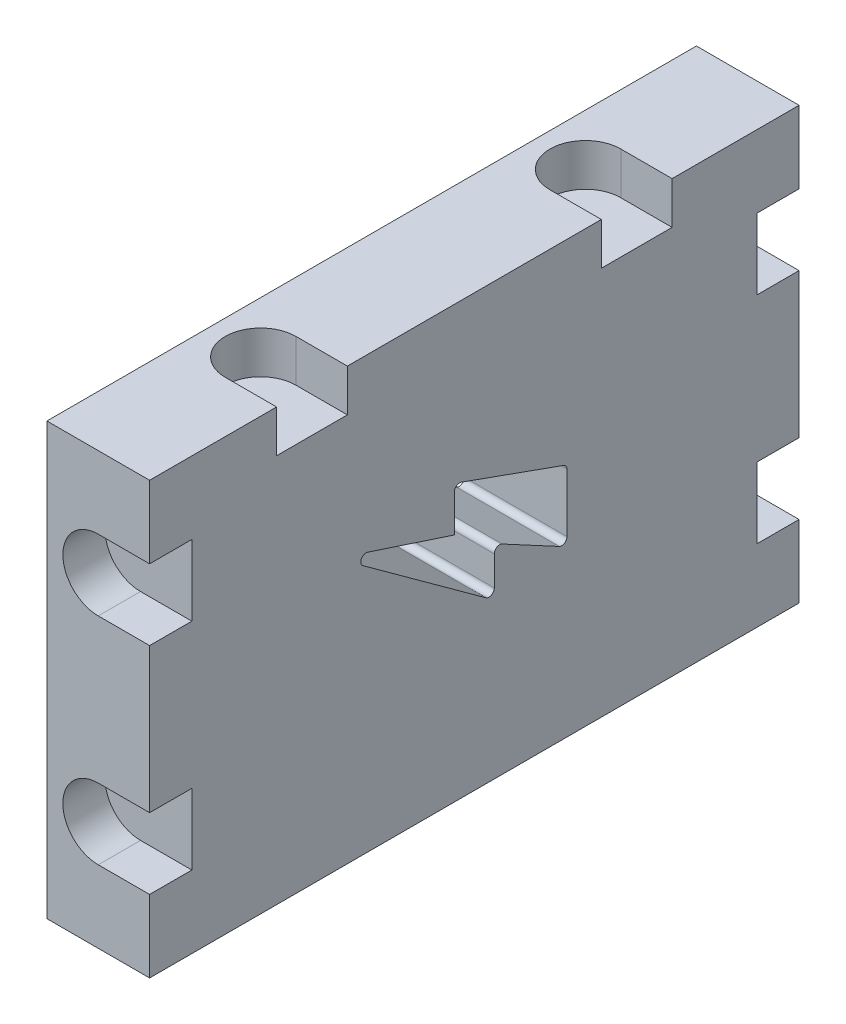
ISO-10303-21;
HEADER;
FILE_DESCRIPTION(('STEP AP214'),'2;1');
FILE_NAME('part.step','',(''),(''),'','','');
FILE_SCHEMA(('AUTOMOTIVE_DESIGN { 1 0 10303 214 1 1 1 1 }'));
ENDSEC;
DATA;
#1=APPLICATION_CONTEXT('core data for automotive mechanical design processes');
#2=APPLICATION_PROTOCOL_DEFINITION('international standard','automotive_design',2000,#1);
#3=PRODUCT_CONTEXT('',#1,'mechanical');
#4=PRODUCT('Part','Part','',(#3));
#5=PRODUCT_RELATED_PRODUCT_CATEGORY('part','',(#4));
#6=PRODUCT_DEFINITION_FORMATION('','',#4);
#7=PRODUCT_DEFINITION_CONTEXT('part definition',#1,'design');
#8=PRODUCT_DEFINITION('design','',#6,#7);
#9=PRODUCT_DEFINITION_SHAPE('','',#8);
#10=(LENGTH_UNIT() NAMED_UNIT(*) SI_UNIT(.MILLI.,.METRE.));
#11=(NAMED_UNIT(*) PLANE_ANGLE_UNIT() SI_UNIT($,.RADIAN.));
#12=(NAMED_UNIT(*) SI_UNIT($,.STERADIAN.) SOLID_ANGLE_UNIT());
#13=UNCERTAINTY_MEASURE_WITH_UNIT(LENGTH_MEASURE(1.E-05),#10,'distance_accuracy_value','');
#14=(GEOMETRIC_REPRESENTATION_CONTEXT(3) GLOBAL_UNCERTAINTY_ASSIGNED_CONTEXT((#13)) GLOBAL_UNIT_ASSIGNED_CONTEXT((#10,
#11,#12)) REPRESENTATION_CONTEXT('',''));
#15=CARTESIAN_POINT('',(0.,0.,0.));
#16=DIRECTION('',(0.,0.,1.));
#17=DIRECTION('',(1.,0.,0.));
#18=AXIS2_PLACEMENT_3D('',#15,#16,#17);
#19=CARTESIAN_POINT('',(-821.069349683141,746.835138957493,0.));
#20=DIRECTION('',(1.,0.,0.));
#21=DIRECTION('',(0.,0.,-1.));
#22=AXIS2_PLACEMENT_3D('',#19,#20,#21);
#23=PLANE('',#22);
#24=CARTESIAN_POINT('',(-821.069349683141,638.866565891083,-49.5375809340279));
#25=DIRECTION('',(-1.,0.,0.));
#26=DIRECTION('',(0.,0.,1.));
#27=AXIS2_PLACEMENT_3D('',#24,#25,#26);
#28=CIRCLE('',#27,0.63499999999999);
#29=CARTESIAN_POINT('',(-821.069349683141,638.307029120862,-49.2373416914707));
#30=VERTEX_POINT('',#29);
#31=CARTESIAN_POINT('',(-821.069349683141,638.866565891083,-50.1725809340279));
#32=VERTEX_POINT('',#31);
#33=EDGE_CURVE('E360',#30,#32,#28,.F.);
#34=ORIENTED_EDGE('',*,*,#33,.F.);
#35=DIRECTION('',(0.,-0.472817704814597,-0.881160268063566));
#36=VECTOR('',#35,1.);
#37=CARTESIAN_POINT('',(-821.069349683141,516.122955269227,-276.94402477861));
#38=LINE('',#37,#36);
#39=CARTESIAN_POINT('',(-821.069349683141,641.990844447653,-42.3720494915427));
#40=VERTEX_POINT('',#39);
#41=EDGE_CURVE('E357',#40,#30,#38,.T.);
#42=ORIENTED_EDGE('',*,*,#41,.F.);
#43=CARTESIAN_POINT('',(-821.069349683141,641.431307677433,-42.0718102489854));
#44=DIRECTION('',(-1.,0.,0.));
#45=DIRECTION('',(0.,0.,1.));
#46=AXIS2_PLACEMENT_3D('',#43,#44,#45);
#47=CIRCLE('',#46,0.634999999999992);
#48=CARTESIAN_POINT('',(-821.069349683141,641.431307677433,-41.4368102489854));
#49=VERTEX_POINT('',#48);
#50=EDGE_CURVE('E363',#40,#49,#47,.F.);
#51=ORIENTED_EDGE('',*,*,#50,.T.);
#52=DIRECTION('',(0.,1.,0.));
#53=VECTOR('',#52,1.);
#54=CARTESIAN_POINT('',(-821.069349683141,0.,-41.4368102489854));
#55=LINE('',#54,#53);
#56=CARTESIAN_POINT('',(-821.069349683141,637.879291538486,-41.4368102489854));
#57=VERTEX_POINT('',#56);
#58=EDGE_CURVE('E367',#57,#49,#55,.T.);
#59=ORIENTED_EDGE('',*,*,#58,.F.);
#60=CARTESIAN_POINT('',(-821.069349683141,637.879291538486,-40.8018102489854));
#61=DIRECTION('',(-1.,0.,0.));
#62=DIRECTION('',(0.,0.,1.));
#63=AXIS2_PLACEMENT_3D('',#60,#61,#62);
#64=CIRCLE('',#63,0.634999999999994);
#65=CARTESIAN_POINT('',(-821.069349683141,637.365495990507,-40.4286626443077));
#66=VERTEX_POINT('',#65);
#67=EDGE_CURVE('E379',#66,#57,#64,.F.);
#68=ORIENTED_EDGE('',*,*,#67,.F.);
#69=DIRECTION('',(0.,-0.58763402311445,-0.80912684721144));
#70=VECTOR('',#69,1.);
#71=CARTESIAN_POINT('',(-821.069349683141,436.497064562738,-317.009041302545));
#72=LINE('',#71,#70);
#73=CARTESIAN_POINT('',(-821.069349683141,648.10137604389,-25.646181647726));
#74=VERTEX_POINT('',#73);
#75=EDGE_CURVE('E381',#74,#66,#72,.T.);
#76=ORIENTED_EDGE('',*,*,#75,.F.);
#77=CARTESIAN_POINT('',(-821.069349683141,648.615171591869,-26.0193292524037));
#78=DIRECTION('',(-1.,0.,0.));
#79=DIRECTION('',(0.,0.,1.));
#80=AXIS2_PLACEMENT_3D('',#77,#78,#79);
#81=CIRCLE('',#80,0.635000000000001);
#82=CARTESIAN_POINT('',(-821.069349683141,649.218479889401,-26.2174304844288));
#83=VERTEX_POINT('',#82);
#84=EDGE_CURVE('E383',#83,#74,#81,.F.);
#85=ORIENTED_EDGE('',*,*,#84,.F.);
#86=DIRECTION('',(0.,0.311970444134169,0.950091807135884));
#87=VECTOR('',#86,1.);
#88=CARTESIAN_POINT('',(-821.069349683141,593.803790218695,-194.980349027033));
#89=LINE('',#88,#87);
#90=CARTESIAN_POINT('',(-821.069349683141,645.795227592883,-36.6427897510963));
#91=VERTEX_POINT('',#90);
#92=EDGE_CURVE('E385',#91,#83,#89,.T.);
#93=ORIENTED_EDGE('',*,*,#92,.F.);
#94=DIRECTION('',(0.,-1.,0.));
#95=VECTOR('',#94,1.);
#96=CARTESIAN_POINT('',(-821.069349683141,0.,-36.6427897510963));
#97=LINE('',#96,#95);
#98=CARTESIAN_POINT('',(-821.069349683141,650.273160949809,-36.6427897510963));
#99=VERTEX_POINT('',#98);
#100=EDGE_CURVE('E387',#99,#91,#97,.T.);
#101=ORIENTED_EDGE('',*,*,#100,.F.);
#102=CARTESIAN_POINT('',(-821.069349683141,650.273160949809,-37.2777897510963));
#103=DIRECTION('',(-1.,0.,0.));
#104=DIRECTION('',(0.,0.,1.));
#105=AXIS2_PLACEMENT_3D('',#102,#103,#104);
#106=CIRCLE('',#105,0.635000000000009);
#107=CARTESIAN_POINT('',(-821.069349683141,650.870953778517,-37.4919596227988));
#108=VERTEX_POINT('',#107);
#109=EDGE_CURVE('E389',#108,#99,#106,.F.);
#110=ORIENTED_EDGE('',*,*,#109,.F.);
#111=DIRECTION('',(0.,0.337275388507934,0.941406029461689));
#112=VECTOR('',#111,1.);
#113=CARTESIAN_POINT('',(-821.069349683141,588.735519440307,-210.924930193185));
#114=LINE('',#113,#112);
#115=CARTESIAN_POINT('',(-821.069349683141,646.478666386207,-49.7517508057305));
#116=VERTEX_POINT('',#115);
#117=EDGE_CURVE('E391',#116,#108,#114,.T.);
#118=ORIENTED_EDGE('',*,*,#117,.F.);
#119=CARTESIAN_POINT('',(-821.069349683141,645.880873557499,-49.5375809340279));
#120=DIRECTION('',(-1.,0.,0.));
#121=DIRECTION('',(0.,0.,1.));
#122=AXIS2_PLACEMENT_3D('',#119,#120,#121);
#123=CIRCLE('',#122,0.635000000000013);
#124=CARTESIAN_POINT('',(-821.069349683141,645.880873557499,-50.1725809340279));
#125=VERTEX_POINT('',#124);
#126=EDGE_CURVE('E393',#125,#116,#123,.F.);
#127=ORIENTED_EDGE('',*,*,#126,.F.);
#128=DIRECTION('',(0.,1.,0.));
#129=VECTOR('',#128,1.);
#130=CARTESIAN_POINT('',(-821.069349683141,0.,-50.1725809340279));
#131=LINE('',#130,#129);
#132=EDGE_CURVE('E395',#32,#125,#131,.T.);
#133=ORIENTED_EDGE('',*,*,#132,.F.);
#134=EDGE_LOOP('',(#34,#42,#51,#59,#68,#76,#85,#93,#101,#110,#118,#127,#133));
#135=FACE_BOUND('',#134,.T.);
#136=DIRECTION('',(0.,-1.,0.));
#137=VECTOR('',#136,1.);
#138=CARTESIAN_POINT('',(-821.069349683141,746.835138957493,-78.0796));
#139=LINE('',#138,#137);
#140=CARTESIAN_POINT('',(-821.069349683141,652.60515215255,-78.0796));
#141=VERTEX_POINT('',#140);
#142=CARTESIAN_POINT('',(-821.069349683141,635.203353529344,-78.0796));
#143=VERTEX_POINT('',#142);
#144=EDGE_CURVE('E667',#141,#143,#139,.T.);
#145=ORIENTED_EDGE('',*,*,#144,.F.);
#146=DIRECTION('',(0.,0.,-1.));
#147=VECTOR('',#146,1.);
#148=CARTESIAN_POINT('',(-821.069349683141,652.60515215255,-72.9996));
#149=LINE('',#148,#147);
#150=CARTESIAN_POINT('',(-821.069349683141,652.60515215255,-72.9996));
#151=VERTEX_POINT('',#150);
#152=EDGE_CURVE('E479',#151,#141,#149,.T.);
#153=ORIENTED_EDGE('',*,*,#152,.F.);
#154=DIRECTION('',(0.,-1.,0.));
#155=VECTOR('',#154,1.);
#156=CARTESIAN_POINT('',(-821.069349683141,0.,-72.9996));
#157=LINE('',#156,#155);
#158=CARTESIAN_POINT('',(-821.069349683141,661.11415215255,-72.9996));
#159=VERTEX_POINT('',#158);
#160=EDGE_CURVE('E460',#159,#151,#157,.T.);
#161=ORIENTED_EDGE('',*,*,#160,.F.);
#162=DIRECTION('',(0.,0.,-1.));
#163=VECTOR('',#162,1.);
#164=CARTESIAN_POINT('',(-821.069349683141,661.11415215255,-72.9996));
#165=LINE('',#164,#163);
#166=CARTESIAN_POINT('',(-821.069349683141,661.11415215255,-78.0796));
#167=VERTEX_POINT('',#166);
#168=EDGE_CURVE('E481',#159,#167,#165,.T.);
#169=ORIENTED_EDGE('',*,*,#168,.T.);
#170=CARTESIAN_POINT('',(-821.069349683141,669.815051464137,-78.0796));
#171=VERTEX_POINT('',#170);
#172=EDGE_CURVE('E665',#171,#167,#139,.T.);
#173=ORIENTED_EDGE('',*,*,#172,.F.);
#174=DIRECTION('',(0.,0.,1.));
#175=VECTOR('',#174,1.);
#176=CARTESIAN_POINT('',(-821.069349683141,669.815051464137,0.));
#177=LINE('',#176,#175);
#178=CARTESIAN_POINT('',(-821.069349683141,669.815051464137,-62.8141999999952));
#179=VERTEX_POINT('',#178);
#180=EDGE_CURVE('E647',#171,#179,#177,.T.);
#181=ORIENTED_EDGE('',*,*,#180,.T.);
#182=DIRECTION('',(0.,1.,0.));
#183=VECTOR('',#182,1.);
#184=CARTESIAN_POINT('',(-821.069349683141,664.735051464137,-62.8141999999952));
#185=LINE('',#184,#183);
#186=CARTESIAN_POINT('',(-821.069349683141,664.735051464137,-62.8141999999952));
#187=VERTEX_POINT('',#186);
#188=EDGE_CURVE('E599',#187,#179,#185,.T.);
#189=ORIENTED_EDGE('',*,*,#188,.F.);
#190=DIRECTION('',(0.,0.,-1.));
#191=VECTOR('',#190,1.);
#192=CARTESIAN_POINT('',(-821.069349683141,664.735051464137,0.));
#193=LINE('',#192,#191);
#194=CARTESIAN_POINT('',(-821.069349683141,664.735051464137,-54.305199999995));
#195=VERTEX_POINT('',#194);
#196=EDGE_CURVE('E580',#195,#187,#193,.T.);
#197=ORIENTED_EDGE('',*,*,#196,.F.);
#198=DIRECTION('',(0.,1.,0.));
#199=VECTOR('',#198,1.);
#200=CARTESIAN_POINT('',(-821.069349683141,664.735051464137,-54.305199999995));
#201=LINE('',#200,#199);
#202=CARTESIAN_POINT('',(-821.069349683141,669.815051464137,-54.305199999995));
#203=VERTEX_POINT('',#202);
#204=EDGE_CURVE('E601',#195,#203,#201,.T.);
#205=ORIENTED_EDGE('',*,*,#204,.T.);
#206=CARTESIAN_POINT('',(-821.069349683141,669.815051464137,-23.7743999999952));
#207=VERTEX_POINT('',#206);
#208=EDGE_CURVE('E651',#203,#207,#177,.T.);
#209=ORIENTED_EDGE('',*,*,#208,.T.);
#210=DIRECTION('',(0.,1.,0.));
#211=VECTOR('',#210,1.);
#212=CARTESIAN_POINT('',(-821.069349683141,664.735051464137,-23.7743999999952));
#213=LINE('',#212,#211);
#214=CARTESIAN_POINT('',(-821.069349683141,664.735051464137,-23.7743999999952));
#215=VERTEX_POINT('',#214);
#216=EDGE_CURVE('E627',#215,#207,#213,.T.);
#217=ORIENTED_EDGE('',*,*,#216,.F.);
#218=DIRECTION('',(0.,0.,-1.));
#219=VECTOR('',#218,1.);
#220=CARTESIAN_POINT('',(-821.069349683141,664.735051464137,0.));
#221=LINE('',#220,#219);
#222=CARTESIAN_POINT('',(-821.069349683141,664.735051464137,-15.265399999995));
#223=VERTEX_POINT('',#222);
#224=EDGE_CURVE('E612',#223,#215,#221,.T.);
#225=ORIENTED_EDGE('',*,*,#224,.F.);
#226=DIRECTION('',(0.,1.,0.));
#227=VECTOR('',#226,1.);
#228=CARTESIAN_POINT('',(-821.069349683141,664.735051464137,-15.265399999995));
#229=LINE('',#228,#227);
#230=CARTESIAN_POINT('',(-821.069349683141,669.815051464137,-15.265399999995));
#231=VERTEX_POINT('',#230);
#232=EDGE_CURVE('E629',#223,#231,#229,.T.);
#233=ORIENTED_EDGE('',*,*,#232,.T.);
#234=CARTESIAN_POINT('',(-821.069349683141,669.815051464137,0.));
#235=VERTEX_POINT('',#234);
#236=EDGE_CURVE('E646',#231,#235,#177,.T.);
#237=ORIENTED_EDGE('',*,*,#236,.T.);
#238=DIRECTION('',(0.,1.,0.));
#239=VECTOR('',#238,1.);
#240=CARTESIAN_POINT('',(-821.069349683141,746.835138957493,0.));
#241=LINE('',#240,#239);
#242=CARTESIAN_POINT('',(-821.069349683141,661.114152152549,0.));
#243=VERTEX_POINT('',#242);
#244=EDGE_CURVE('E100',#243,#235,#241,.T.);
#245=ORIENTED_EDGE('',*,*,#244,.F.);
#246=DIRECTION('',(0.,0.,1.));
#247=VECTOR('',#246,1.);
#248=CARTESIAN_POINT('',(-821.069349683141,661.114152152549,-5.08));
#249=LINE('',#248,#247);
#250=CARTESIAN_POINT('',(-821.069349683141,661.114152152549,-5.08));
#251=VERTEX_POINT('',#250);
#252=EDGE_CURVE('E567',#251,#243,#249,.T.);
#253=ORIENTED_EDGE('',*,*,#252,.F.);
#254=DIRECTION('',(0.,1.,0.));
#255=VECTOR('',#254,1.);
#256=CARTESIAN_POINT('',(-821.069349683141,0.,-5.08));
#257=LINE('',#256,#255);
#258=CARTESIAN_POINT('',(-821.069349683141,652.605152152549,-5.08));
#259=VERTEX_POINT('',#258);
#260=EDGE_CURVE('E552',#259,#251,#257,.T.);
#261=ORIENTED_EDGE('',*,*,#260,.F.);
#262=DIRECTION('',(0.,0.,1.));
#263=VECTOR('',#262,1.);
#264=CARTESIAN_POINT('',(-821.069349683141,652.605152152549,-5.08));
#265=LINE('',#264,#263);
#266=CARTESIAN_POINT('',(-821.069349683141,652.605152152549,0.));
#267=VERTEX_POINT('',#266);
#268=EDGE_CURVE('E569',#259,#267,#265,.T.);
#269=ORIENTED_EDGE('',*,*,#268,.T.);
#270=CARTESIAN_POINT('',(-821.069349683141,635.203353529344,0.));
#271=VERTEX_POINT('',#270);
#272=EDGE_CURVE('E99',#271,#267,#241,.T.);
#273=ORIENTED_EDGE('',*,*,#272,.F.);
#274=DIRECTION('',(0.,0.,1.));
#275=VECTOR('',#274,1.);
#276=CARTESIAN_POINT('',(-821.069349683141,635.203353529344,-5.08));
#277=LINE('',#276,#275);
#278=CARTESIAN_POINT('',(-821.069349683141,635.203353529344,-5.08));
#279=VERTEX_POINT('',#278);
#280=EDGE_CURVE('E539',#279,#271,#277,.T.);
#281=ORIENTED_EDGE('',*,*,#280,.F.);
#282=DIRECTION('',(0.,1.,0.));
#283=VECTOR('',#282,1.);
#284=CARTESIAN_POINT('',(-821.069349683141,0.,-5.08));
#285=LINE('',#284,#283);
#286=CARTESIAN_POINT('',(-821.069349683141,626.694353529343,-5.08));
#287=VERTEX_POINT('',#286);
#288=EDGE_CURVE('E520',#287,#279,#285,.T.);
#289=ORIENTED_EDGE('',*,*,#288,.F.);
#290=DIRECTION('',(0.,0.,1.));
#291=VECTOR('',#290,1.);
#292=CARTESIAN_POINT('',(-821.069349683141,626.694353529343,-5.08));
#293=LINE('',#292,#291);
#294=CARTESIAN_POINT('',(-821.069349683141,626.694353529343,0.));
#295=VERTEX_POINT('',#294);
#296=EDGE_CURVE('E541',#287,#295,#293,.T.);
#297=ORIENTED_EDGE('',*,*,#296,.T.);
#298=CARTESIAN_POINT('',(-821.069349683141,617.993454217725,0.));
#299=VERTEX_POINT('',#298);
#300=EDGE_CURVE('E12',#299,#295,#241,.T.);
#301=ORIENTED_EDGE('',*,*,#300,.F.);
#302=DIRECTION('',(0.,0.,-1.));
#303=VECTOR('',#302,1.);
#304=CARTESIAN_POINT('',(-821.069349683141,617.993454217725,0.));
#305=LINE('',#304,#303);
#306=CARTESIAN_POINT('',(-821.069349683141,617.993454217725,-78.0796));
#307=VERTEX_POINT('',#306);
#308=EDGE_CURVE('E662',#299,#307,#305,.T.);
#309=ORIENTED_EDGE('',*,*,#308,.T.);
#310=CARTESIAN_POINT('',(-821.069349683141,626.694353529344,-78.0796));
#311=VERTEX_POINT('',#310);
#312=EDGE_CURVE('E664',#311,#307,#139,.T.);
#313=ORIENTED_EDGE('',*,*,#312,.F.);
#314=DIRECTION('',(0.,0.,-1.));
#315=VECTOR('',#314,1.);
#316=CARTESIAN_POINT('',(-821.069349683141,626.694353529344,-72.9996));
#317=LINE('',#316,#315);
#318=CARTESIAN_POINT('',(-821.069349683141,626.694353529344,-72.9996));
#319=VERTEX_POINT('',#318);
#320=EDGE_CURVE('E507',#319,#311,#317,.T.);
#321=ORIENTED_EDGE('',*,*,#320,.F.);
#322=DIRECTION('',(0.,-1.,0.));
#323=VECTOR('',#322,1.);
#324=CARTESIAN_POINT('',(-821.069349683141,0.,-72.9996));
#325=LINE('',#324,#323);
#326=CARTESIAN_POINT('',(-821.069349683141,635.203353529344,-72.9996));
#327=VERTEX_POINT('',#326);
#328=EDGE_CURVE('E492',#327,#319,#325,.T.);
#329=ORIENTED_EDGE('',*,*,#328,.F.);
#330=DIRECTION('',(0.,0.,-1.));
#331=VECTOR('',#330,1.);
#332=CARTESIAN_POINT('',(-821.069349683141,635.203353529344,-72.9996));
#333=LINE('',#332,#331);
#334=EDGE_CURVE('E509',#327,#143,#333,.T.);
#335=ORIENTED_EDGE('',*,*,#334,.T.);
#336=EDGE_LOOP('',(#145,#153,#161,#169,#173,#181,#189,#197,#205,#209,#217,#225,#233,#237,#245,
#253,#261,#269,#273,#281,#289,#297,#301,#309,#313,#321,#329,#335));
#337=FACE_BOUND('',#336,.T.);
#338=ADVANCED_FACE('F91',(#135,#337),#23,.T.);
#339=CARTESIAN_POINT('',(0.,1230.90690843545,-78.0796));
#340=DIRECTION('',(0.,0.,-1.));
#341=DIRECTION('',(-1.,0.,0.));
#342=AXIS2_PLACEMENT_3D('',#339,#340,#341);
#343=PLANE('',#342);
#344=CARTESIAN_POINT('',(-827.139949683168,656.85965215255,-78.0796));
#345=DIRECTION('',(0.,0.,-1.));
#346=DIRECTION('',(-1.,0.,0.));
#347=AXIS2_PLACEMENT_3D('',#344,#345,#346);
#348=CIRCLE('',#347,4.25450000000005);
#349=CARTESIAN_POINT('',(-827.139949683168,661.11415215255,-78.0796));
#350=VERTEX_POINT('',#349);
#351=CARTESIAN_POINT('',(-827.139949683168,652.60515215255,-78.0796));
#352=VERTEX_POINT('',#351);
#353=EDGE_CURVE('E466',#350,#352,#348,.F.);
#354=ORIENTED_EDGE('',*,*,#353,.T.);
#355=DIRECTION('',(1.,0.,0.));
#356=VECTOR('',#355,1.);
#357=CARTESIAN_POINT('',(-1.17387198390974E-11,652.605152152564,-78.0796));
#358=LINE('',#357,#356);
#359=EDGE_CURVE('E458',#352,#141,#358,.T.);
#360=ORIENTED_EDGE('',*,*,#359,.T.);
#361=ORIENTED_EDGE('',*,*,#144,.T.);
#362=DIRECTION('',(-1.,0.,0.));
#363=VECTOR('',#362,1.);
#364=CARTESIAN_POINT('',(-1.14257053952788E-11,635.203353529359,-78.0796));
#365=LINE('',#364,#363);
#366=CARTESIAN_POINT('',(-827.139949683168,635.203353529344,-78.0796));
#367=VERTEX_POINT('',#366);
#368=EDGE_CURVE('E500',#143,#367,#365,.T.);
#369=ORIENTED_EDGE('',*,*,#368,.T.);
#370=CARTESIAN_POINT('',(-827.139949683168,630.948853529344,-78.0796));
#371=DIRECTION('',(0.,0.,-1.));
#372=DIRECTION('',(-1.,0.,0.));
#373=AXIS2_PLACEMENT_3D('',#370,#371,#372);
#374=CIRCLE('',#373,4.25450000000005);
#375=CARTESIAN_POINT('',(-827.139949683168,626.694353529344,-78.0796));
#376=VERTEX_POINT('',#375);
#377=EDGE_CURVE('E432',#367,#376,#374,.F.);
#378=ORIENTED_EDGE('',*,*,#377,.T.);
#379=DIRECTION('',(1.,0.,0.));
#380=VECTOR('',#379,1.);
#381=CARTESIAN_POINT('',(-1.12726499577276E-11,626.694353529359,-78.0796));
#382=LINE('',#381,#380);
#383=EDGE_CURVE('E490',#376,#311,#382,.T.);
#384=ORIENTED_EDGE('',*,*,#383,.T.);
#385=ORIENTED_EDGE('',*,*,#312,.T.);
#386=DIRECTION('',(1.,0.,0.));
#387=VECTOR('',#386,1.);
#388=CARTESIAN_POINT('',(-820.002549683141,617.993454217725,-78.0796));
#389=LINE('',#388,#387);
#390=CARTESIAN_POINT('',(-833.413749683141,617.993454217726,-78.0796));
#391=VERTEX_POINT('',#390);
#392=EDGE_CURVE('E650',#391,#307,#389,.T.);
#393=ORIENTED_EDGE('',*,*,#392,.F.);
#394=DIRECTION('',(0.,-1.,0.));
#395=VECTOR('',#394,1.);
#396=CARTESIAN_POINT('',(-833.413749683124,1230.90690843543,-78.0796));
#397=LINE('',#396,#395);
#398=CARTESIAN_POINT('',(-833.413749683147,669.815051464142,-78.0796));
#399=VERTEX_POINT('',#398);
#400=EDGE_CURVE('E636',#399,#391,#397,.T.);
#401=ORIENTED_EDGE('',*,*,#400,.F.);
#402=DIRECTION('',(-1.,0.,0.));
#403=VECTOR('',#402,1.);
#404=CARTESIAN_POINT('',(-899.286453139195,669.815051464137,-78.0796));
#405=LINE('',#404,#403);
#406=EDGE_CURVE('E640',#171,#399,#405,.T.);
#407=ORIENTED_EDGE('',*,*,#406,.F.);
#408=ORIENTED_EDGE('',*,*,#172,.T.);
#409=DIRECTION('',(-1.,0.,0.));
#410=VECTOR('',#409,1.);
#411=CARTESIAN_POINT('',(-1.18917752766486E-11,661.114152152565,-78.0796));
#412=LINE('',#411,#410);
#413=EDGE_CURVE('E469',#167,#350,#412,.T.);
#414=ORIENTED_EDGE('',*,*,#413,.T.);
#415=EDGE_LOOP('',(#354,#360,#361,#369,#378,#384,#385,#393,#401,#407,#408,#414));
#416=FACE_BOUND('',#415,.T.);
#417=ADVANCED_FACE('F673',(#416),#343,.T.);
#418=CARTESIAN_POINT('',(0.,1230.90690843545,0.));
#419=DIRECTION('',(0.,0.,1.));
#420=DIRECTION('',(1.,0.,0.));
#421=AXIS2_PLACEMENT_3D('',#418,#419,#420);
#422=PLANE('',#421);
#423=CARTESIAN_POINT('',(-827.241549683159,630.948853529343,0.));
#424=DIRECTION('',(0.,0.,1.));
#425=DIRECTION('',(1.,0.,0.));
#426=AXIS2_PLACEMENT_3D('',#423,#424,#425);
#427=CIRCLE('',#426,4.25450000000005);
#428=CARTESIAN_POINT('',(-827.241549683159,626.694353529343,0.));
#429=VERTEX_POINT('',#428);
#430=CARTESIAN_POINT('',(-827.241549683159,635.203353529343,0.));
#431=VERTEX_POINT('',#430);
#432=EDGE_CURVE('E526',#429,#431,#427,.F.);
#433=ORIENTED_EDGE('',*,*,#432,.T.);
#434=DIRECTION('',(1.,0.,0.));
#435=VECTOR('',#434,1.);
#436=CARTESIAN_POINT('',(-1.14257053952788E-11,635.203353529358,0.));
#437=LINE('',#436,#435);
#438=EDGE_CURVE('E518',#431,#271,#437,.T.);
#439=ORIENTED_EDGE('',*,*,#438,.T.);
#440=ORIENTED_EDGE('',*,*,#272,.T.);
#441=DIRECTION('',(-1.,0.,0.));
#442=VECTOR('',#441,1.);
#443=CARTESIAN_POINT('',(-1.17387198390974E-11,652.605152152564,0.));
#444=LINE('',#443,#442);
#445=CARTESIAN_POINT('',(-827.241549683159,652.605152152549,0.));
#446=VERTEX_POINT('',#445);
#447=EDGE_CURVE('E560',#267,#446,#444,.T.);
#448=ORIENTED_EDGE('',*,*,#447,.T.);
#449=CARTESIAN_POINT('',(-827.241549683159,656.859652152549,0.));
#450=DIRECTION('',(0.,0.,1.));
#451=DIRECTION('',(1.,0.,0.));
#452=AXIS2_PLACEMENT_3D('',#449,#450,#451);
#453=CIRCLE('',#452,4.25450000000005);
#454=CARTESIAN_POINT('',(-827.241549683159,661.114152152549,0.));
#455=VERTEX_POINT('',#454);
#456=EDGE_CURVE('E478',#446,#455,#453,.F.);
#457=ORIENTED_EDGE('',*,*,#456,.T.);
#458=DIRECTION('',(1.,0.,0.));
#459=VECTOR('',#458,1.);
#460=CARTESIAN_POINT('',(-1.18917752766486E-11,661.114152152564,0.));
#461=LINE('',#460,#459);
#462=EDGE_CURVE('E550',#455,#243,#461,.T.);
#463=ORIENTED_EDGE('',*,*,#462,.T.);
#464=ORIENTED_EDGE('',*,*,#244,.T.);
#465=DIRECTION('',(1.,0.,0.));
#466=VECTOR('',#465,1.);
#467=CARTESIAN_POINT('',(-899.286453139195,669.815051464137,0.));
#468=LINE('',#467,#466);
#469=CARTESIAN_POINT('',(-833.413749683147,669.815051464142,2.22044604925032E-13));
#470=VERTEX_POINT('',#469);
#471=EDGE_CURVE('E643',#470,#235,#468,.T.);
#472=ORIENTED_EDGE('',*,*,#471,.F.);
#473=DIRECTION('',(0.,1.,0.));
#474=VECTOR('',#473,1.);
#475=CARTESIAN_POINT('',(-833.413749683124,1230.90690843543,2.22044604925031E-13));
#476=LINE('',#475,#474);
#477=CARTESIAN_POINT('',(-833.413749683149,617.993454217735,2.22044604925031E-13));
#478=VERTEX_POINT('',#477);
#479=EDGE_CURVE('E637',#478,#470,#476,.T.);
#480=ORIENTED_EDGE('',*,*,#479,.F.);
#481=DIRECTION('',(1.,0.,0.));
#482=VECTOR('',#481,1.);
#483=CARTESIAN_POINT('',(0.,617.993454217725,0.));
#484=LINE('',#483,#482);
#485=EDGE_CURVE('E652',#478,#299,#484,.T.);
#486=ORIENTED_EDGE('',*,*,#485,.T.);
#487=ORIENTED_EDGE('',*,*,#300,.T.);
#488=DIRECTION('',(-1.,0.,0.));
#489=VECTOR('',#488,1.);
#490=CARTESIAN_POINT('',(-1.12726499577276E-11,626.694353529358,0.));
#491=LINE('',#490,#489);
#492=EDGE_CURVE('E529',#295,#429,#491,.T.);
#493=ORIENTED_EDGE('',*,*,#492,.T.);
#494=EDGE_LOOP('',(#433,#439,#440,#448,#457,#463,#464,#472,#480,#486,#487,#493));
#495=FACE_BOUND('',#494,.T.);
#496=ADVANCED_FACE('F710',(#495),#422,.T.);
#497=CARTESIAN_POINT('',(-899.286453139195,669.815051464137,0.));
#498=DIRECTION('',(0.,-1.,0.));
#499=DIRECTION('',(0.,0.,1.));
#500=AXIS2_PLACEMENT_3D('',#497,#498,#499);
#501=PLANE('',#500);
#502=DIRECTION('',(1.,0.,0.));
#503=VECTOR('',#502,1.);
#504=CARTESIAN_POINT('',(-4.23700854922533E-13,669.815051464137,-62.8142000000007));
#505=LINE('',#504,#503);
#506=CARTESIAN_POINT('',(-827.24154968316,669.815051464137,-62.8141999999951));
#507=VERTEX_POINT('',#506);
#508=EDGE_CURVE('E578',#507,#179,#505,.T.);
#509=ORIENTED_EDGE('',*,*,#508,.T.);
#510=ORIENTED_EDGE('',*,*,#180,.F.);
#511=ORIENTED_EDGE('',*,*,#406,.T.);
#512=DIRECTION('',(0.,0.,-1.));
#513=VECTOR('',#512,1.);
#514=CARTESIAN_POINT('',(-833.413749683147,669.815051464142,2.22044604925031E-13));
#515=LINE('',#514,#513);
#516=EDGE_CURVE('E598',#470,#399,#515,.T.);
#517=ORIENTED_EDGE('',*,*,#516,.F.);
#518=ORIENTED_EDGE('',*,*,#471,.T.);
#519=ORIENTED_EDGE('',*,*,#236,.F.);
#520=DIRECTION('',(-1.,0.,0.));
#521=VECTOR('',#520,1.);
#522=CARTESIAN_POINT('',(-1.02969758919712E-13,669.815051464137,-15.2654000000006));
#523=LINE('',#522,#521);
#524=CARTESIAN_POINT('',(-827.241549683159,669.815051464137,-15.265399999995));
#525=VERTEX_POINT('',#524);
#526=EDGE_CURVE('E620',#231,#525,#523,.T.);
#527=ORIENTED_EDGE('',*,*,#526,.T.);
#528=CARTESIAN_POINT('',(-827.241549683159,669.815051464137,-19.5198999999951));
#529=DIRECTION('',(0.,1.,0.));
#530=DIRECTION('',(0.,0.,1.));
#531=AXIS2_PLACEMENT_3D('',#528,#529,#530);
#532=CIRCLE('',#531,4.25450000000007);
#533=CARTESIAN_POINT('',(-827.241549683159,669.815051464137,-23.7743999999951));
#534=VERTEX_POINT('',#533);
#535=EDGE_CURVE('E538',#525,#534,#532,.F.);
#536=ORIENTED_EDGE('',*,*,#535,.T.);
#537=DIRECTION('',(1.,0.,0.));
#538=VECTOR('',#537,1.);
#539=CARTESIAN_POINT('',(-1.60365548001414E-13,669.815051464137,-23.7744000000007));
#540=LINE('',#539,#538);
#541=EDGE_CURVE('E610',#534,#207,#540,.T.);
#542=ORIENTED_EDGE('',*,*,#541,.T.);
#543=ORIENTED_EDGE('',*,*,#208,.F.);
#544=DIRECTION('',(-1.,0.,0.));
#545=VECTOR('',#544,1.);
#546=CARTESIAN_POINT('',(-3.66305065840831E-13,669.815051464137,-54.3052000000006));
#547=LINE('',#546,#545);
#548=CARTESIAN_POINT('',(-827.24154968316,669.815051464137,-54.305199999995));
#549=VERTEX_POINT('',#548);
#550=EDGE_CURVE('E589',#203,#549,#547,.T.);
#551=ORIENTED_EDGE('',*,*,#550,.T.);
#552=CARTESIAN_POINT('',(-827.24154968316,669.815051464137,-58.5596999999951));
#553=DIRECTION('',(0.,1.,0.));
#554=DIRECTION('',(0.,0.,1.));
#555=AXIS2_PLACEMENT_3D('',#552,#553,#554);
#556=CIRCLE('',#555,4.25450000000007);
#557=EDGE_CURVE('E586',#549,#507,#556,.F.);
#558=ORIENTED_EDGE('',*,*,#557,.T.);
#559=EDGE_LOOP('',(#509,#510,#511,#517,#518,#519,#527,#536,#542,#543,#551,#558));
#560=FACE_BOUND('',#559,.T.);
#561=ADVANCED_FACE('F688',(#560),#501,.F.);
#562=CARTESIAN_POINT('',(-833.413749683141,1230.90690843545,0.));
#563=DIRECTION('',(-1.,0.,0.));
#564=DIRECTION('',(0.,0.,1.));
#565=AXIS2_PLACEMENT_3D('',#562,#563,#564);
#566=PLANE('',#565);
#567=CARTESIAN_POINT('',(-833.413749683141,641.431307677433,-42.0718102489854));
#568=DIRECTION('',(-1.,0.,0.));
#569=DIRECTION('',(0.,0.,1.));
#570=AXIS2_PLACEMENT_3D('',#567,#568,#569);
#571=CIRCLE('',#570,0.634999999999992);
#572=CARTESIAN_POINT('',(-833.413749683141,641.990844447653,-42.3720494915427));
#573=VERTEX_POINT('',#572);
#574=CARTESIAN_POINT('',(-833.413749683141,641.431307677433,-41.4368102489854));
#575=VERTEX_POINT('',#574);
#576=EDGE_CURVE('E399',#573,#575,#571,.F.);
#577=ORIENTED_EDGE('',*,*,#576,.F.);
#578=DIRECTION('',(0.,-0.472817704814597,-0.881160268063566));
#579=VECTOR('',#578,1.);
#580=CARTESIAN_POINT('',(-833.413749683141,516.122955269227,-276.94402477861));
#581=LINE('',#580,#579);
#582=CARTESIAN_POINT('',(-833.413749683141,638.307029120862,-49.2373416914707));
#583=VERTEX_POINT('',#582);
#584=EDGE_CURVE('E115',#573,#583,#581,.T.);
#585=ORIENTED_EDGE('',*,*,#584,.T.);
#586=CARTESIAN_POINT('',(-833.413749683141,638.866565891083,-49.5375809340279));
#587=DIRECTION('',(-1.,0.,0.));
#588=DIRECTION('',(0.,0.,1.));
#589=AXIS2_PLACEMENT_3D('',#586,#587,#588);
#590=CIRCLE('',#589,0.63499999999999);
#591=CARTESIAN_POINT('',(-833.413749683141,638.866565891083,-50.1725809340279));
#592=VERTEX_POINT('',#591);
#593=EDGE_CURVE('E372',#583,#592,#590,.F.);
#594=ORIENTED_EDGE('',*,*,#593,.T.);
#595=DIRECTION('',(0.,1.,0.));
#596=VECTOR('',#595,1.);
#597=CARTESIAN_POINT('',(-833.413749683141,0.,-50.1725809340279));
#598=LINE('',#597,#596);
#599=CARTESIAN_POINT('',(-833.413749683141,645.880873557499,-50.1725809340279));
#600=VERTEX_POINT('',#599);
#601=EDGE_CURVE('E375',#592,#600,#598,.T.);
#602=ORIENTED_EDGE('',*,*,#601,.T.);
#603=CARTESIAN_POINT('',(-833.413749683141,645.880873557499,-49.5375809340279));
#604=DIRECTION('',(-1.,0.,0.));
#605=DIRECTION('',(0.,0.,1.));
#606=AXIS2_PLACEMENT_3D('',#603,#604,#605);
#607=CIRCLE('',#606,0.635000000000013);
#608=CARTESIAN_POINT('',(-833.413749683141,646.478666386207,-49.7517508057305));
#609=VERTEX_POINT('',#608);
#610=EDGE_CURVE('E425',#600,#609,#607,.F.);
#611=ORIENTED_EDGE('',*,*,#610,.T.);
#612=DIRECTION('',(0.,0.337275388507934,0.941406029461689));
#613=VECTOR('',#612,1.);
#614=CARTESIAN_POINT('',(-833.413749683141,588.735519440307,-210.924930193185));
#615=LINE('',#614,#613);
#616=CARTESIAN_POINT('',(-833.413749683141,650.870953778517,-37.4919596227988));
#617=VERTEX_POINT('',#616);
#618=EDGE_CURVE('E422',#609,#617,#615,.T.);
#619=ORIENTED_EDGE('',*,*,#618,.T.);
#620=CARTESIAN_POINT('',(-833.413749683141,650.273160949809,-37.2777897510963));
#621=DIRECTION('',(-1.,0.,0.));
#622=DIRECTION('',(0.,0.,1.));
#623=AXIS2_PLACEMENT_3D('',#620,#621,#622);
#624=CIRCLE('',#623,0.635000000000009);
#625=CARTESIAN_POINT('',(-833.413749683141,650.273160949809,-36.6427897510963));
#626=VERTEX_POINT('',#625);
#627=EDGE_CURVE('E419',#617,#626,#624,.F.);
#628=ORIENTED_EDGE('',*,*,#627,.T.);
#629=DIRECTION('',(0.,-1.,0.));
#630=VECTOR('',#629,1.);
#631=CARTESIAN_POINT('',(-833.413749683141,0.,-36.6427897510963));
#632=LINE('',#631,#630);
#633=CARTESIAN_POINT('',(-833.413749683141,645.795227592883,-36.6427897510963));
#634=VERTEX_POINT('',#633);
#635=EDGE_CURVE('E416',#626,#634,#632,.T.);
#636=ORIENTED_EDGE('',*,*,#635,.T.);
#637=DIRECTION('',(0.,0.311970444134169,0.950091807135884));
#638=VECTOR('',#637,1.);
#639=CARTESIAN_POINT('',(-833.413749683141,593.803790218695,-194.980349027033));
#640=LINE('',#639,#638);
#641=CARTESIAN_POINT('',(-833.413749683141,649.218479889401,-26.2174304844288));
#642=VERTEX_POINT('',#641);
#643=EDGE_CURVE('E413',#634,#642,#640,.T.);
#644=ORIENTED_EDGE('',*,*,#643,.T.);
#645=CARTESIAN_POINT('',(-833.413749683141,648.615171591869,-26.0193292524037));
#646=DIRECTION('',(-1.,0.,0.));
#647=DIRECTION('',(0.,0.,1.));
#648=AXIS2_PLACEMENT_3D('',#645,#646,#647);
#649=CIRCLE('',#648,0.635000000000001);
#650=CARTESIAN_POINT('',(-833.413749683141,648.10137604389,-25.646181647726));
#651=VERTEX_POINT('',#650);
#652=EDGE_CURVE('E410',#642,#651,#649,.F.);
#653=ORIENTED_EDGE('',*,*,#652,.T.);
#654=DIRECTION('',(0.,-0.58763402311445,-0.80912684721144));
#655=VECTOR('',#654,1.);
#656=CARTESIAN_POINT('',(-833.413749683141,436.497064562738,-317.009041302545));
#657=LINE('',#656,#655);
#658=CARTESIAN_POINT('',(-833.413749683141,637.365495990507,-40.4286626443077));
#659=VERTEX_POINT('',#658);
#660=EDGE_CURVE('E407',#651,#659,#657,.T.);
#661=ORIENTED_EDGE('',*,*,#660,.T.);
#662=CARTESIAN_POINT('',(-833.413749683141,637.879291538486,-40.8018102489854));
#663=DIRECTION('',(-1.,0.,0.));
#664=DIRECTION('',(0.,0.,1.));
#665=AXIS2_PLACEMENT_3D('',#662,#663,#664);
#666=CIRCLE('',#665,0.634999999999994);
#667=CARTESIAN_POINT('',(-833.413749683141,637.879291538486,-41.4368102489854));
#668=VERTEX_POINT('',#667);
#669=EDGE_CURVE('E404',#659,#668,#666,.F.);
#670=ORIENTED_EDGE('',*,*,#669,.T.);
#671=DIRECTION('',(0.,1.,0.));
#672=VECTOR('',#671,1.);
#673=CARTESIAN_POINT('',(-833.413749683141,0.,-41.4368102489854));
#674=LINE('',#673,#672);
#675=EDGE_CURVE('E401',#668,#575,#674,.T.);
#676=ORIENTED_EDGE('',*,*,#675,.T.);
#677=EDGE_LOOP('',(#577,#585,#594,#602,#611,#619,#628,#636,#644,#653,#661,#670,#676));
#678=FACE_BOUND('',#677,.T.);
#679=ORIENTED_EDGE('',*,*,#479,.T.);
#680=ORIENTED_EDGE('',*,*,#516,.T.);
#681=ORIENTED_EDGE('',*,*,#400,.T.);
#682=DIRECTION('',(0.,0.,-1.));
#683=VECTOR('',#682,1.);
#684=CARTESIAN_POINT('',(-833.413749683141,617.993454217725,6.35));
#685=LINE('',#684,#683);
#686=EDGE_CURVE('E656',#478,#391,#685,.T.);
#687=ORIENTED_EDGE('',*,*,#686,.F.);
#688=EDGE_LOOP('',(#679,#680,#681,#687));
#689=FACE_BOUND('',#688,.T.);
#690=ADVANCED_FACE('F682',(#678,#689),#566,.T.);
#691=CARTESIAN_POINT('',(0.,617.993454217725,6.35));
#692=DIRECTION('',(0.,-1.,0.));
#693=DIRECTION('',(0.,0.,1.));
#694=AXIS2_PLACEMENT_3D('',#691,#692,#693);
#695=PLANE('',#694);
#696=ORIENTED_EDGE('',*,*,#485,.F.);
#697=ORIENTED_EDGE('',*,*,#686,.T.);
#698=ORIENTED_EDGE('',*,*,#392,.T.);
#699=ORIENTED_EDGE('',*,*,#308,.F.);
#700=EDGE_LOOP('',(#696,#697,#698,#699));
#701=FACE_BOUND('',#700,.T.);
#702=ADVANCED_FACE('F93',(#701),#695,.T.);
#703=CARTESIAN_POINT('',(-827.241549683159,664.735051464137,-19.5198999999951));
#704=DIRECTION('',(0.,1.,0.));
#705=DIRECTION('',(0.,0.,1.));
#706=AXIS2_PLACEMENT_3D('',#703,#704,#705);
#707=CYLINDRICAL_SURFACE('',#706,4.25450000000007);
#708=ORIENTED_EDGE('',*,*,#535,.F.);
#709=DIRECTION('',(0.,1.,0.));
#710=VECTOR('',#709,1.);
#711=CARTESIAN_POINT('',(-827.241549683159,664.735051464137,-15.265399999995));
#712=LINE('',#711,#710);
#713=CARTESIAN_POINT('',(-827.241549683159,664.735051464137,-15.265399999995));
#714=VERTEX_POINT('',#713);
#715=EDGE_CURVE('E617',#714,#525,#712,.T.);
#716=ORIENTED_EDGE('',*,*,#715,.F.);
#717=CARTESIAN_POINT('',(-827.241549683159,664.735051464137,-19.5198999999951));
#718=DIRECTION('',(0.,1.,0.));
#719=DIRECTION('',(0.,0.,1.));
#720=AXIS2_PLACEMENT_3D('',#717,#718,#719);
#721=CIRCLE('',#720,4.25450000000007);
#722=CARTESIAN_POINT('',(-827.241549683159,664.735051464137,-23.7743999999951));
#723=VERTEX_POINT('',#722);
#724=EDGE_CURVE('E606',#714,#723,#721,.F.);
#725=ORIENTED_EDGE('',*,*,#724,.T.);
#726=DIRECTION('',(0.,1.,0.));
#727=VECTOR('',#726,1.);
#728=CARTESIAN_POINT('',(-827.241549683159,664.735051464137,-23.7743999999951));
#729=LINE('',#728,#727);
#730=EDGE_CURVE('E590',#723,#534,#729,.T.);
#731=ORIENTED_EDGE('',*,*,#730,.T.);
#732=EDGE_LOOP('',(#708,#716,#725,#731));
#733=FACE_BOUND('',#732,.T.);
#734=ADVANCED_FACE('F763',(#733),#707,.F.);
#735=CARTESIAN_POINT('',(-1.60365548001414E-13,664.735051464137,-23.7744000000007));
#736=DIRECTION('',(0.,0.,1.));
#737=DIRECTION('',(1.,0.,0.));
#738=AXIS2_PLACEMENT_3D('',#735,#736,#737);
#739=PLANE('',#738);
#740=ORIENTED_EDGE('',*,*,#541,.F.);
#741=ORIENTED_EDGE('',*,*,#730,.F.);
#742=DIRECTION('',(1.,0.,0.));
#743=VECTOR('',#742,1.);
#744=CARTESIAN_POINT('',(-1.60365548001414E-13,664.735051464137,-23.7744000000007));
#745=LINE('',#744,#743);
#746=EDGE_CURVE('E615',#723,#215,#745,.T.);
#747=ORIENTED_EDGE('',*,*,#746,.T.);
#748=ORIENTED_EDGE('',*,*,#216,.T.);
#749=EDGE_LOOP('',(#740,#741,#747,#748));
#750=FACE_BOUND('',#749,.T.);
#751=ADVANCED_FACE('F766',(#750),#739,.T.);
#752=CARTESIAN_POINT('',(-1.02969758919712E-13,664.735051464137,-15.2654000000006));
#753=DIRECTION('',(0.,0.,-1.));
#754=DIRECTION('',(-1.,0.,0.));
#755=AXIS2_PLACEMENT_3D('',#752,#753,#754);
#756=PLANE('',#755);
#757=ORIENTED_EDGE('',*,*,#526,.F.);
#758=ORIENTED_EDGE('',*,*,#232,.F.);
#759=DIRECTION('',(-1.,0.,0.));
#760=VECTOR('',#759,1.);
#761=CARTESIAN_POINT('',(-1.02969758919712E-13,664.735051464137,-15.2654000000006));
#762=LINE('',#761,#760);
#763=EDGE_CURVE('E609',#223,#714,#762,.T.);
#764=ORIENTED_EDGE('',*,*,#763,.T.);
#765=ORIENTED_EDGE('',*,*,#715,.T.);
#766=EDGE_LOOP('',(#757,#758,#764,#765));
#767=FACE_BOUND('',#766,.T.);
#768=ADVANCED_FACE('F768',(#767),#756,.T.);
#769=CARTESIAN_POINT('',(0.,664.735051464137,0.));
#770=DIRECTION('',(0.,1.,0.));
#771=DIRECTION('',(0.,0.,1.));
#772=AXIS2_PLACEMENT_3D('',#769,#770,#771);
#773=PLANE('',#772);
#774=ORIENTED_EDGE('',*,*,#724,.F.);
#775=ORIENTED_EDGE('',*,*,#763,.F.);
#776=ORIENTED_EDGE('',*,*,#224,.T.);
#777=ORIENTED_EDGE('',*,*,#746,.F.);
#778=EDGE_LOOP('',(#774,#775,#776,#777));
#779=FACE_BOUND('',#778,.T.);
#780=ADVANCED_FACE('F771',(#779),#773,.T.);
#781=CARTESIAN_POINT('',(-827.24154968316,664.735051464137,-58.5596999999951));
#782=DIRECTION('',(0.,1.,0.));
#783=DIRECTION('',(0.,0.,1.));
#784=AXIS2_PLACEMENT_3D('',#781,#782,#783);
#785=CYLINDRICAL_SURFACE('',#784,4.25450000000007);
#786=ORIENTED_EDGE('',*,*,#557,.F.);
#787=DIRECTION('',(0.,1.,0.));
#788=VECTOR('',#787,1.);
#789=CARTESIAN_POINT('',(-827.24154968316,664.735051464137,-54.305199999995));
#790=LINE('',#789,#788);
#791=CARTESIAN_POINT('',(-827.24154968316,664.735051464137,-54.305199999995));
#792=VERTEX_POINT('',#791);
#793=EDGE_CURVE('E585',#792,#549,#790,.T.);
#794=ORIENTED_EDGE('',*,*,#793,.F.);
#795=CARTESIAN_POINT('',(-827.24154968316,664.735051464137,-58.5596999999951));
#796=DIRECTION('',(0.,1.,0.));
#797=DIRECTION('',(0.,0.,1.));
#798=AXIS2_PLACEMENT_3D('',#795,#796,#797);
#799=CIRCLE('',#798,4.25450000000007);
#800=CARTESIAN_POINT('',(-827.24154968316,664.735051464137,-62.8141999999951));
#801=VERTEX_POINT('',#800);
#802=EDGE_CURVE('E574',#792,#801,#799,.F.);
#803=ORIENTED_EDGE('',*,*,#802,.T.);
#804=DIRECTION('',(0.,1.,0.));
#805=VECTOR('',#804,1.);
#806=CARTESIAN_POINT('',(-827.24154968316,664.735051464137,-62.8141999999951));
#807=LINE('',#806,#805);
#808=EDGE_CURVE('E595',#801,#507,#807,.T.);
#809=ORIENTED_EDGE('',*,*,#808,.T.);
#810=EDGE_LOOP('',(#786,#794,#803,#809));
#811=FACE_BOUND('',#810,.T.);
#812=ADVANCED_FACE('F693',(#811),#785,.F.);
#813=CARTESIAN_POINT('',(-4.23700854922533E-13,664.735051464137,-62.8142000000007));
#814=DIRECTION('',(0.,0.,1.));
#815=DIRECTION('',(1.,0.,0.));
#816=AXIS2_PLACEMENT_3D('',#813,#814,#815);
#817=PLANE('',#816);
#818=ORIENTED_EDGE('',*,*,#508,.F.);
#819=ORIENTED_EDGE('',*,*,#808,.F.);
#820=DIRECTION('',(1.,0.,0.));
#821=VECTOR('',#820,1.);
#822=CARTESIAN_POINT('',(-4.23700854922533E-13,664.735051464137,-62.8142000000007));
#823=LINE('',#822,#821);
#824=EDGE_CURVE('E583',#801,#187,#823,.T.);
#825=ORIENTED_EDGE('',*,*,#824,.T.);
#826=ORIENTED_EDGE('',*,*,#188,.T.);
#827=EDGE_LOOP('',(#818,#819,#825,#826));
#828=FACE_BOUND('',#827,.T.);
#829=ADVANCED_FACE('F691',(#828),#817,.T.);
#830=CARTESIAN_POINT('',(-3.66305065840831E-13,664.735051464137,-54.3052000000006));
#831=DIRECTION('',(0.,0.,-1.));
#832=DIRECTION('',(-1.,0.,0.));
#833=AXIS2_PLACEMENT_3D('',#830,#831,#832);
#834=PLANE('',#833);
#835=ORIENTED_EDGE('',*,*,#550,.F.);
#836=ORIENTED_EDGE('',*,*,#204,.F.);
#837=DIRECTION('',(-1.,0.,0.));
#838=VECTOR('',#837,1.);
#839=CARTESIAN_POINT('',(-3.66305065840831E-13,664.735051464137,-54.3052000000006));
#840=LINE('',#839,#838);
#841=EDGE_CURVE('E577',#195,#792,#840,.T.);
#842=ORIENTED_EDGE('',*,*,#841,.T.);
#843=ORIENTED_EDGE('',*,*,#793,.T.);
#844=EDGE_LOOP('',(#835,#836,#842,#843));
#845=FACE_BOUND('',#844,.T.);
#846=ADVANCED_FACE('F781',(#845),#834,.T.);
#847=CARTESIAN_POINT('',(0.,664.735051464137,0.));
#848=DIRECTION('',(0.,1.,0.));
#849=DIRECTION('',(0.,0.,1.));
#850=AXIS2_PLACEMENT_3D('',#847,#848,#849);
#851=PLANE('',#850);
#852=ORIENTED_EDGE('',*,*,#802,.F.);
#853=ORIENTED_EDGE('',*,*,#841,.F.);
#854=ORIENTED_EDGE('',*,*,#196,.T.);
#855=ORIENTED_EDGE('',*,*,#824,.F.);
#856=EDGE_LOOP('',(#852,#853,#854,#855));
#857=FACE_BOUND('',#856,.T.);
#858=ADVANCED_FACE('F698',(#857),#851,.T.);
#859=CARTESIAN_POINT('',(-827.241549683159,656.859652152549,-5.08));
#860=DIRECTION('',(0.,0.,1.));
#861=DIRECTION('',(1.,0.,0.));
#862=AXIS2_PLACEMENT_3D('',#859,#860,#861);
#863=CYLINDRICAL_SURFACE('',#862,4.25450000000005);
#864=ORIENTED_EDGE('',*,*,#456,.F.);
#865=DIRECTION('',(0.,0.,1.));
#866=VECTOR('',#865,1.);
#867=CARTESIAN_POINT('',(-827.241549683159,652.605152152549,-5.08));
#868=LINE('',#867,#866);
#869=CARTESIAN_POINT('',(-827.241549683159,652.605152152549,-5.08));
#870=VERTEX_POINT('',#869);
#871=EDGE_CURVE('E557',#870,#446,#868,.T.);
#872=ORIENTED_EDGE('',*,*,#871,.F.);
#873=CARTESIAN_POINT('',(-827.241549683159,656.859652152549,-5.08));
#874=DIRECTION('',(0.,0.,1.));
#875=DIRECTION('',(1.,0.,0.));
#876=AXIS2_PLACEMENT_3D('',#873,#874,#875);
#877=CIRCLE('',#876,4.25450000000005);
#878=CARTESIAN_POINT('',(-827.241549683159,661.114152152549,-5.08));
#879=VERTEX_POINT('',#878);
#880=EDGE_CURVE('E546',#870,#879,#877,.F.);
#881=ORIENTED_EDGE('',*,*,#880,.T.);
#882=DIRECTION('',(0.,0.,1.));
#883=VECTOR('',#882,1.);
#884=CARTESIAN_POINT('',(-827.241549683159,661.114152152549,-5.08));
#885=LINE('',#884,#883);
#886=EDGE_CURVE('E530',#879,#455,#885,.T.);
#887=ORIENTED_EDGE('',*,*,#886,.T.);
#888=EDGE_LOOP('',(#864,#872,#881,#887));
#889=FACE_BOUND('',#888,.T.);
#890=ADVANCED_FACE('F715',(#889),#863,.F.);
#891=CARTESIAN_POINT('',(-1.18917752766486E-11,661.114152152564,-5.08));
#892=DIRECTION('',(0.,-1.,0.));
#893=DIRECTION('',(1.,0.,0.));
#894=AXIS2_PLACEMENT_3D('',#891,#892,#893);
#895=PLANE('',#894);
#896=ORIENTED_EDGE('',*,*,#462,.F.);
#897=ORIENTED_EDGE('',*,*,#886,.F.);
#898=DIRECTION('',(1.,0.,0.));
#899=VECTOR('',#898,1.);
#900=CARTESIAN_POINT('',(-1.18917752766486E-11,661.114152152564,-5.08));
#901=LINE('',#900,#899);
#902=EDGE_CURVE('E555',#879,#251,#901,.T.);
#903=ORIENTED_EDGE('',*,*,#902,.T.);
#904=ORIENTED_EDGE('',*,*,#252,.T.);
#905=EDGE_LOOP('',(#896,#897,#903,#904));
#906=FACE_BOUND('',#905,.T.);
#907=ADVANCED_FACE('F713',(#906),#895,.T.);
#908=CARTESIAN_POINT('',(-1.17387198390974E-11,652.605152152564,-5.08));
#909=DIRECTION('',(0.,1.,0.));
#910=DIRECTION('',(-1.,0.,0.));
#911=AXIS2_PLACEMENT_3D('',#908,#909,#910);
#912=PLANE('',#911);
#913=ORIENTED_EDGE('',*,*,#447,.F.);
#914=ORIENTED_EDGE('',*,*,#268,.F.);
#915=DIRECTION('',(-1.,0.,0.));
#916=VECTOR('',#915,1.);
#917=CARTESIAN_POINT('',(-1.17387198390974E-11,652.605152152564,-5.08));
#918=LINE('',#917,#916);
#919=EDGE_CURVE('E549',#259,#870,#918,.T.);
#920=ORIENTED_EDGE('',*,*,#919,.T.);
#921=ORIENTED_EDGE('',*,*,#871,.T.);
#922=EDGE_LOOP('',(#913,#914,#920,#921));
#923=FACE_BOUND('',#922,.T.);
#924=ADVANCED_FACE('F790',(#923),#912,.T.);
#925=CARTESIAN_POINT('',(0.,0.,-5.08));
#926=DIRECTION('',(0.,0.,1.));
#927=DIRECTION('',(1.,0.,0.));
#928=AXIS2_PLACEMENT_3D('',#925,#926,#927);
#929=PLANE('',#928);
#930=ORIENTED_EDGE('',*,*,#880,.F.);
#931=ORIENTED_EDGE('',*,*,#919,.F.);
#932=ORIENTED_EDGE('',*,*,#260,.T.);
#933=ORIENTED_EDGE('',*,*,#902,.F.);
#934=EDGE_LOOP('',(#930,#931,#932,#933));
#935=FACE_BOUND('',#934,.T.);
#936=ADVANCED_FACE('F720',(#935),#929,.T.);
#937=CARTESIAN_POINT('',(-827.241549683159,630.948853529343,-5.08));
#938=DIRECTION('',(0.,0.,1.));
#939=DIRECTION('',(1.,0.,0.));
#940=AXIS2_PLACEMENT_3D('',#937,#938,#939);
#941=CYLINDRICAL_SURFACE('',#940,4.25450000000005);
#942=ORIENTED_EDGE('',*,*,#432,.F.);
#943=DIRECTION('',(0.,0.,1.));
#944=VECTOR('',#943,1.);
#945=CARTESIAN_POINT('',(-827.241549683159,626.694353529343,-5.08));
#946=LINE('',#945,#944);
#947=CARTESIAN_POINT('',(-827.241549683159,626.694353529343,-5.08));
#948=VERTEX_POINT('',#947);
#949=EDGE_CURVE('E525',#948,#429,#946,.T.);
#950=ORIENTED_EDGE('',*,*,#949,.F.);
#951=CARTESIAN_POINT('',(-827.241549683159,630.948853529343,-5.08));
#952=DIRECTION('',(0.,0.,1.));
#953=DIRECTION('',(1.,0.,0.));
#954=AXIS2_PLACEMENT_3D('',#951,#952,#953);
#955=CIRCLE('',#954,4.25450000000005);
#956=CARTESIAN_POINT('',(-827.241549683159,635.203353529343,-5.08));
#957=VERTEX_POINT('',#956);
#958=EDGE_CURVE('E514',#948,#957,#955,.F.);
#959=ORIENTED_EDGE('',*,*,#958,.T.);
#960=DIRECTION('',(0.,0.,1.));
#961=VECTOR('',#960,1.);
#962=CARTESIAN_POINT('',(-827.241549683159,635.203353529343,-5.08));
#963=LINE('',#962,#961);
#964=EDGE_CURVE('E535',#957,#431,#963,.T.);
#965=ORIENTED_EDGE('',*,*,#964,.T.);
#966=EDGE_LOOP('',(#942,#950,#959,#965));
#967=FACE_BOUND('',#966,.T.);
#968=ADVANCED_FACE('F730',(#967),#941,.F.);
#969=CARTESIAN_POINT('',(-1.14257053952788E-11,635.203353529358,-5.08));
#970=DIRECTION('',(0.,-1.,0.));
#971=DIRECTION('',(1.,0.,0.));
#972=AXIS2_PLACEMENT_3D('',#969,#970,#971);
#973=PLANE('',#972);
#974=ORIENTED_EDGE('',*,*,#438,.F.);
#975=ORIENTED_EDGE('',*,*,#964,.F.);
#976=DIRECTION('',(1.,0.,0.));
#977=VECTOR('',#976,1.);
#978=CARTESIAN_POINT('',(-1.14257053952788E-11,635.203353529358,-5.08));
#979=LINE('',#978,#977);
#980=EDGE_CURVE('E523',#957,#279,#979,.T.);
#981=ORIENTED_EDGE('',*,*,#980,.T.);
#982=ORIENTED_EDGE('',*,*,#280,.T.);
#983=EDGE_LOOP('',(#974,#975,#981,#982));
#984=FACE_BOUND('',#983,.T.);
#985=ADVANCED_FACE('F728',(#984),#973,.T.);
#986=CARTESIAN_POINT('',(-1.12726499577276E-11,626.694353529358,-5.08));
#987=DIRECTION('',(0.,1.,0.));
#988=DIRECTION('',(-1.,0.,0.));
#989=AXIS2_PLACEMENT_3D('',#986,#987,#988);
#990=PLANE('',#989);
#991=ORIENTED_EDGE('',*,*,#492,.F.);
#992=ORIENTED_EDGE('',*,*,#296,.F.);
#993=DIRECTION('',(-1.,0.,0.));
#994=VECTOR('',#993,1.);
#995=CARTESIAN_POINT('',(-1.12726499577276E-11,626.694353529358,-5.08));
#996=LINE('',#995,#994);
#997=EDGE_CURVE('E517',#287,#948,#996,.T.);
#998=ORIENTED_EDGE('',*,*,#997,.T.);
#999=ORIENTED_EDGE('',*,*,#949,.T.);
#1000=EDGE_LOOP('',(#991,#992,#998,#999));
#1001=FACE_BOUND('',#1000,.T.);
#1002=ADVANCED_FACE('F738',(#1001),#990,.T.);
#1003=CARTESIAN_POINT('',(0.,0.,-5.08));
#1004=DIRECTION('',(0.,0.,1.));
#1005=DIRECTION('',(1.,0.,0.));
#1006=AXIS2_PLACEMENT_3D('',#1003,#1004,#1005);
#1007=PLANE('',#1006);
#1008=ORIENTED_EDGE('',*,*,#958,.F.);
#1009=ORIENTED_EDGE('',*,*,#997,.F.);
#1010=ORIENTED_EDGE('',*,*,#288,.T.);
#1011=ORIENTED_EDGE('',*,*,#980,.F.);
#1012=EDGE_LOOP('',(#1008,#1009,#1010,#1011));
#1013=FACE_BOUND('',#1012,.T.);
#1014=ADVANCED_FACE('F735',(#1013),#1007,.T.);
#1015=CARTESIAN_POINT('',(-827.139949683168,630.948853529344,-72.9996));
#1016=DIRECTION('',(0.,0.,-1.));
#1017=DIRECTION('',(-1.,0.,0.));
#1018=AXIS2_PLACEMENT_3D('',#1015,#1016,#1017);
#1019=CYLINDRICAL_SURFACE('',#1018,4.25450000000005);
#1020=ORIENTED_EDGE('',*,*,#377,.F.);
#1021=DIRECTION('',(0.,0.,-1.));
#1022=VECTOR('',#1021,1.);
#1023=CARTESIAN_POINT('',(-827.139949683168,635.203353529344,-72.9996));
#1024=LINE('',#1023,#1022);
#1025=CARTESIAN_POINT('',(-827.139949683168,635.203353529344,-72.9996));
#1026=VERTEX_POINT('',#1025);
#1027=EDGE_CURVE('E497',#1026,#367,#1024,.T.);
#1028=ORIENTED_EDGE('',*,*,#1027,.F.);
#1029=CARTESIAN_POINT('',(-827.139949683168,630.948853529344,-72.9996));
#1030=DIRECTION('',(0.,0.,-1.));
#1031=DIRECTION('',(-1.,0.,0.));
#1032=AXIS2_PLACEMENT_3D('',#1029,#1030,#1031);
#1033=CIRCLE('',#1032,4.25450000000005);
#1034=CARTESIAN_POINT('',(-827.139949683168,626.694353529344,-72.9996));
#1035=VERTEX_POINT('',#1034);
#1036=EDGE_CURVE('E486',#1026,#1035,#1033,.F.);
#1037=ORIENTED_EDGE('',*,*,#1036,.T.);
#1038=DIRECTION('',(0.,0.,-1.));
#1039=VECTOR('',#1038,1.);
#1040=CARTESIAN_POINT('',(-827.139949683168,626.694353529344,-72.9996));
#1041=LINE('',#1040,#1039);
#1042=EDGE_CURVE('E470',#1035,#376,#1041,.T.);
#1043=ORIENTED_EDGE('',*,*,#1042,.T.);
#1044=EDGE_LOOP('',(#1020,#1028,#1037,#1043));
#1045=FACE_BOUND('',#1044,.T.);
#1046=ADVANCED_FACE('F745',(#1045),#1019,.F.);
#1047=CARTESIAN_POINT('',(-1.12726499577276E-11,626.694353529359,-72.9996));
#1048=DIRECTION('',(0.,1.,0.));
#1049=DIRECTION('',(-1.,0.,0.));
#1050=AXIS2_PLACEMENT_3D('',#1047,#1048,#1049);
#1051=PLANE('',#1050);
#1052=ORIENTED_EDGE('',*,*,#383,.F.);
#1053=ORIENTED_EDGE('',*,*,#1042,.F.);
#1054=DIRECTION('',(1.,0.,0.));
#1055=VECTOR('',#1054,1.);
#1056=CARTESIAN_POINT('',(-1.12726499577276E-11,626.694353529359,-72.9996));
#1057=LINE('',#1056,#1055);
#1058=EDGE_CURVE('E495',#1035,#319,#1057,.T.);
#1059=ORIENTED_EDGE('',*,*,#1058,.T.);
#1060=ORIENTED_EDGE('',*,*,#320,.T.);
#1061=EDGE_LOOP('',(#1052,#1053,#1059,#1060));
#1062=FACE_BOUND('',#1061,.T.);
#1063=ADVANCED_FACE('F918',(#1062),#1051,.T.);
#1064=CARTESIAN_POINT('',(-1.14257053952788E-11,635.203353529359,-72.9996));
#1065=DIRECTION('',(0.,-1.,0.));
#1066=DIRECTION('',(1.,0.,0.));
#1067=AXIS2_PLACEMENT_3D('',#1064,#1065,#1066);
#1068=PLANE('',#1067);
#1069=ORIENTED_EDGE('',*,*,#368,.F.);
#1070=ORIENTED_EDGE('',*,*,#334,.F.);
#1071=DIRECTION('',(-1.,0.,0.));
#1072=VECTOR('',#1071,1.);
#1073=CARTESIAN_POINT('',(-1.14257053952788E-11,635.203353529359,-72.9996));
#1074=LINE('',#1073,#1072);
#1075=EDGE_CURVE('E489',#327,#1026,#1074,.T.);
#1076=ORIENTED_EDGE('',*,*,#1075,.T.);
#1077=ORIENTED_EDGE('',*,*,#1027,.T.);
#1078=EDGE_LOOP('',(#1069,#1070,#1076,#1077));
#1079=FACE_BOUND('',#1078,.T.);
#1080=ADVANCED_FACE('F928',(#1079),#1068,.T.);
#1081=CARTESIAN_POINT('',(0.,0.,-72.9996));
#1082=DIRECTION('',(0.,0.,-1.));
#1083=DIRECTION('',(-1.,0.,0.));
#1084=AXIS2_PLACEMENT_3D('',#1081,#1082,#1083);
#1085=PLANE('',#1084);
#1086=ORIENTED_EDGE('',*,*,#1036,.F.);
#1087=ORIENTED_EDGE('',*,*,#1075,.F.);
#1088=ORIENTED_EDGE('',*,*,#328,.T.);
#1089=ORIENTED_EDGE('',*,*,#1058,.F.);
#1090=EDGE_LOOP('',(#1086,#1087,#1088,#1089));
#1091=FACE_BOUND('',#1090,.T.);
#1092=ADVANCED_FACE('F938',(#1091),#1085,.T.);
#1093=CARTESIAN_POINT('',(-827.139949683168,656.85965215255,-72.9996));
#1094=DIRECTION('',(0.,0.,-1.));
#1095=DIRECTION('',(-1.,0.,0.));
#1096=AXIS2_PLACEMENT_3D('',#1093,#1094,#1095);
#1097=CYLINDRICAL_SURFACE('',#1096,4.25450000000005);
#1098=ORIENTED_EDGE('',*,*,#353,.F.);
#1099=DIRECTION('',(0.,0.,-1.));
#1100=VECTOR('',#1099,1.);
#1101=CARTESIAN_POINT('',(-827.139949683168,661.11415215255,-72.9996));
#1102=LINE('',#1101,#1100);
#1103=CARTESIAN_POINT('',(-827.139949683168,661.11415215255,-72.9996));
#1104=VERTEX_POINT('',#1103);
#1105=EDGE_CURVE('E465',#1104,#350,#1102,.T.);
#1106=ORIENTED_EDGE('',*,*,#1105,.F.);
#1107=CARTESIAN_POINT('',(-827.139949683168,656.85965215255,-72.9996));
#1108=DIRECTION('',(0.,0.,-1.));
#1109=DIRECTION('',(-1.,0.,0.));
#1110=AXIS2_PLACEMENT_3D('',#1107,#1108,#1109);
#1111=CIRCLE('',#1110,4.25450000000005);
#1112=CARTESIAN_POINT('',(-827.139949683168,652.60515215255,-72.9996));
#1113=VERTEX_POINT('',#1112);
#1114=EDGE_CURVE('E454',#1104,#1113,#1111,.F.);
#1115=ORIENTED_EDGE('',*,*,#1114,.T.);
#1116=DIRECTION('',(0.,0.,-1.));
#1117=VECTOR('',#1116,1.);
#1118=CARTESIAN_POINT('',(-827.139949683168,652.60515215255,-72.9996));
#1119=LINE('',#1118,#1117);
#1120=EDGE_CURVE('E475',#1113,#352,#1119,.T.);
#1121=ORIENTED_EDGE('',*,*,#1120,.T.);
#1122=EDGE_LOOP('',(#1098,#1106,#1115,#1121));
#1123=FACE_BOUND('',#1122,.T.);
#1124=ADVANCED_FACE('F948',(#1123),#1097,.F.);
#1125=CARTESIAN_POINT('',(-1.17387198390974E-11,652.605152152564,-72.9996));
#1126=DIRECTION('',(0.,1.,0.));
#1127=DIRECTION('',(-1.,0.,0.));
#1128=AXIS2_PLACEMENT_3D('',#1125,#1126,#1127);
#1129=PLANE('',#1128);
#1130=ORIENTED_EDGE('',*,*,#359,.F.);
#1131=ORIENTED_EDGE('',*,*,#1120,.F.);
#1132=DIRECTION('',(1.,0.,0.));
#1133=VECTOR('',#1132,1.);
#1134=CARTESIAN_POINT('',(-1.17387198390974E-11,652.605152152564,-72.9996));
#1135=LINE('',#1134,#1133);
#1136=EDGE_CURVE('E463',#1113,#151,#1135,.T.);
#1137=ORIENTED_EDGE('',*,*,#1136,.T.);
#1138=ORIENTED_EDGE('',*,*,#152,.T.);
#1139=EDGE_LOOP('',(#1130,#1131,#1137,#1138));
#1140=FACE_BOUND('',#1139,.T.);
#1141=ADVANCED_FACE('F958',(#1140),#1129,.T.);
#1142=CARTESIAN_POINT('',(-1.18917752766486E-11,661.114152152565,-72.9996));
#1143=DIRECTION('',(0.,-1.,0.));
#1144=DIRECTION('',(1.,0.,0.));
#1145=AXIS2_PLACEMENT_3D('',#1142,#1143,#1144);
#1146=PLANE('',#1145);
#1147=ORIENTED_EDGE('',*,*,#413,.F.);
#1148=ORIENTED_EDGE('',*,*,#168,.F.);
#1149=DIRECTION('',(-1.,0.,0.));
#1150=VECTOR('',#1149,1.);
#1151=CARTESIAN_POINT('',(-1.18917752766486E-11,661.114152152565,-72.9996));
#1152=LINE('',#1151,#1150);
#1153=EDGE_CURVE('E457',#159,#1104,#1152,.T.);
#1154=ORIENTED_EDGE('',*,*,#1153,.T.);
#1155=ORIENTED_EDGE('',*,*,#1105,.T.);
#1156=EDGE_LOOP('',(#1147,#1148,#1154,#1155));
#1157=FACE_BOUND('',#1156,.T.);
#1158=ADVANCED_FACE('F968',(#1157),#1146,.T.);
#1159=CARTESIAN_POINT('',(0.,0.,-72.9996));
#1160=DIRECTION('',(0.,0.,-1.));
#1161=DIRECTION('',(-1.,0.,0.));
#1162=AXIS2_PLACEMENT_3D('',#1159,#1160,#1161);
#1163=PLANE('',#1162);
#1164=ORIENTED_EDGE('',*,*,#1114,.F.);
#1165=ORIENTED_EDGE('',*,*,#1153,.F.);
#1166=ORIENTED_EDGE('',*,*,#160,.T.);
#1167=ORIENTED_EDGE('',*,*,#1136,.F.);
#1168=EDGE_LOOP('',(#1164,#1165,#1166,#1167));
#1169=FACE_BOUND('',#1168,.T.);
#1170=ADVANCED_FACE('F978',(#1169),#1163,.T.);
#1171=CARTESIAN_POINT('',(-821.069349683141,516.122955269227,-276.94402477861));
#1172=DIRECTION('',(0.,0.881160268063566,-0.472817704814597));
#1173=DIRECTION('',(0.,0.472817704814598,0.881160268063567));
#1174=AXIS2_PLACEMENT_3D('',#1171,#1172,#1173);
#1175=PLANE('',#1174);
#1176=ORIENTED_EDGE('',*,*,#584,.F.);
#1177=DIRECTION('',(-1.,0.,0.));
#1178=VECTOR('',#1177,1.);
#1179=CARTESIAN_POINT('',(-821.069349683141,641.990844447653,-42.3720494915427));
#1180=LINE('',#1179,#1178);
#1181=EDGE_CURVE('E354',#40,#573,#1180,.T.);
#1182=ORIENTED_EDGE('',*,*,#1181,.F.);
#1183=ORIENTED_EDGE('',*,*,#41,.T.);
#1184=DIRECTION('',(-1.,0.,0.));
#1185=VECTOR('',#1184,1.);
#1186=CARTESIAN_POINT('',(-821.069349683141,638.307029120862,-49.2373416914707));
#1187=LINE('',#1186,#1185);
#1188=EDGE_CURVE('E430',#30,#583,#1187,.T.);
#1189=ORIENTED_EDGE('',*,*,#1188,.T.);
#1190=EDGE_LOOP('',(#1176,#1182,#1183,#1189));
#1191=FACE_BOUND('',#1190,.T.);
#1192=ADVANCED_FACE('F355',(#1191),#1175,.T.);
#1193=CARTESIAN_POINT('',(-821.069349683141,638.866565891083,-49.5375809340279));
#1194=DIRECTION('',(-1.,0.,0.));
#1195=DIRECTION('',(0.,0.,1.));
#1196=AXIS2_PLACEMENT_3D('',#1193,#1194,#1195);
#1197=CYLINDRICAL_SURFACE('',#1196,0.63499999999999);
#1198=ORIENTED_EDGE('',*,*,#593,.F.);
#1199=ORIENTED_EDGE('',*,*,#1188,.F.);
#1200=ORIENTED_EDGE('',*,*,#33,.T.);
#1201=DIRECTION('',(-1.,0.,0.));
#1202=VECTOR('',#1201,1.);
#1203=CARTESIAN_POINT('',(-821.069349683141,638.866565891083,-50.1725809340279));
#1204=LINE('',#1203,#1202);
#1205=EDGE_CURVE('E433',#32,#592,#1204,.T.);
#1206=ORIENTED_EDGE('',*,*,#1205,.T.);
#1207=EDGE_LOOP('',(#1198,#1199,#1200,#1206));
#1208=FACE_BOUND('',#1207,.T.);
#1209=ADVANCED_FACE('F996',(#1208),#1197,.F.);
#1210=CARTESIAN_POINT('',(-821.069349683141,0.,-50.1725809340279));
#1211=DIRECTION('',(0.,0.,1.));
#1212=DIRECTION('',(1.,0.,0.));
#1213=AXIS2_PLACEMENT_3D('',#1210,#1211,#1212);
#1214=PLANE('',#1213);
#1215=ORIENTED_EDGE('',*,*,#601,.F.);
#1216=ORIENTED_EDGE('',*,*,#1205,.F.);
#1217=ORIENTED_EDGE('',*,*,#132,.T.);
#1218=DIRECTION('',(-1.,0.,0.));
#1219=VECTOR('',#1218,1.);
#1220=CARTESIAN_POINT('',(-821.069349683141,645.880873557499,-50.1725809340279));
#1221=LINE('',#1220,#1219);
#1222=EDGE_CURVE('E435',#125,#600,#1221,.T.);
#1223=ORIENTED_EDGE('',*,*,#1222,.T.);
#1224=EDGE_LOOP('',(#1215,#1216,#1217,#1223));
#1225=FACE_BOUND('',#1224,.T.);
#1226=ADVANCED_FACE('F1005',(#1225),#1214,.T.);
#1227=CARTESIAN_POINT('',(-821.069349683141,645.880873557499,-49.5375809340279));
#1228=DIRECTION('',(-1.,0.,0.));
#1229=DIRECTION('',(0.,0.,1.));
#1230=AXIS2_PLACEMENT_3D('',#1227,#1228,#1229);
#1231=CYLINDRICAL_SURFACE('',#1230,0.635000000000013);
#1232=ORIENTED_EDGE('',*,*,#610,.F.);
#1233=ORIENTED_EDGE('',*,*,#1222,.F.);
#1234=ORIENTED_EDGE('',*,*,#126,.T.);
#1235=DIRECTION('',(-1.,0.,0.));
#1236=VECTOR('',#1235,1.);
#1237=CARTESIAN_POINT('',(-821.069349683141,646.478666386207,-49.7517508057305));
#1238=LINE('',#1237,#1236);
#1239=EDGE_CURVE('E437',#116,#609,#1238,.T.);
#1240=ORIENTED_EDGE('',*,*,#1239,.T.);
#1241=EDGE_LOOP('',(#1232,#1233,#1234,#1240));
#1242=FACE_BOUND('',#1241,.T.);
#1243=ADVANCED_FACE('F1015',(#1242),#1231,.F.);
#1244=CARTESIAN_POINT('',(-821.069349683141,588.735519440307,-210.924930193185));
#1245=DIRECTION('',(0.,-0.941406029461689,0.337275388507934));
#1246=DIRECTION('',(0.,-0.337275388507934,-0.941406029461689));
#1247=AXIS2_PLACEMENT_3D('',#1244,#1245,#1246);
#1248=PLANE('',#1247);
#1249=ORIENTED_EDGE('',*,*,#618,.F.);
#1250=ORIENTED_EDGE('',*,*,#1239,.F.);
#1251=ORIENTED_EDGE('',*,*,#117,.T.);
#1252=DIRECTION('',(-1.,0.,0.));
#1253=VECTOR('',#1252,1.);
#1254=CARTESIAN_POINT('',(-821.069349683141,650.870953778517,-37.4919596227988));
#1255=LINE('',#1254,#1253);
#1256=EDGE_CURVE('E439',#108,#617,#1255,.T.);
#1257=ORIENTED_EDGE('',*,*,#1256,.T.);
#1258=EDGE_LOOP('',(#1249,#1250,#1251,#1257));
#1259=FACE_BOUND('',#1258,.T.);
#1260=ADVANCED_FACE('F1025',(#1259),#1248,.T.);
#1261=CARTESIAN_POINT('',(-821.069349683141,650.273160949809,-37.2777897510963));
#1262=DIRECTION('',(-1.,0.,0.));
#1263=DIRECTION('',(0.,0.,1.));
#1264=AXIS2_PLACEMENT_3D('',#1261,#1262,#1263);
#1265=CYLINDRICAL_SURFACE('',#1264,0.635000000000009);
#1266=ORIENTED_EDGE('',*,*,#627,.F.);
#1267=ORIENTED_EDGE('',*,*,#1256,.F.);
#1268=ORIENTED_EDGE('',*,*,#109,.T.);
#1269=DIRECTION('',(-1.,0.,0.));
#1270=VECTOR('',#1269,1.);
#1271=CARTESIAN_POINT('',(-821.069349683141,650.273160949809,-36.6427897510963));
#1272=LINE('',#1271,#1270);
#1273=EDGE_CURVE('E441',#99,#626,#1272,.T.);
#1274=ORIENTED_EDGE('',*,*,#1273,.T.);
#1275=EDGE_LOOP('',(#1266,#1267,#1268,#1274));
#1276=FACE_BOUND('',#1275,.T.);
#1277=ADVANCED_FACE('F1035',(#1276),#1265,.F.);
#1278=CARTESIAN_POINT('',(-821.069349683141,0.,-36.6427897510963));
#1279=DIRECTION('',(0.,0.,-1.));
#1280=DIRECTION('',(-1.,0.,0.));
#1281=AXIS2_PLACEMENT_3D('',#1278,#1279,#1280);
#1282=PLANE('',#1281);
#1283=ORIENTED_EDGE('',*,*,#635,.F.);
#1284=ORIENTED_EDGE('',*,*,#1273,.F.);
#1285=ORIENTED_EDGE('',*,*,#100,.T.);
#1286=DIRECTION('',(-1.,0.,0.));
#1287=VECTOR('',#1286,1.);
#1288=CARTESIAN_POINT('',(-821.069349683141,645.795227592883,-36.6427897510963));
#1289=LINE('',#1288,#1287);
#1290=EDGE_CURVE('E443',#91,#634,#1289,.T.);
#1291=ORIENTED_EDGE('',*,*,#1290,.T.);
#1292=EDGE_LOOP('',(#1283,#1284,#1285,#1291));
#1293=FACE_BOUND('',#1292,.T.);
#1294=ADVANCED_FACE('F1045',(#1293),#1282,.T.);
#1295=CARTESIAN_POINT('',(-821.069349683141,593.803790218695,-194.980349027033));
#1296=DIRECTION('',(0.,-0.950091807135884,0.311970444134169));
#1297=DIRECTION('',(0.,-0.311970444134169,-0.950091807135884));
#1298=AXIS2_PLACEMENT_3D('',#1295,#1296,#1297);
#1299=PLANE('',#1298);
#1300=ORIENTED_EDGE('',*,*,#643,.F.);
#1301=ORIENTED_EDGE('',*,*,#1290,.F.);
#1302=ORIENTED_EDGE('',*,*,#92,.T.);
#1303=DIRECTION('',(-1.,0.,0.));
#1304=VECTOR('',#1303,1.);
#1305=CARTESIAN_POINT('',(-821.069349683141,649.218479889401,-26.2174304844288));
#1306=LINE('',#1305,#1304);
#1307=EDGE_CURVE('E445',#83,#642,#1306,.T.);
#1308=ORIENTED_EDGE('',*,*,#1307,.T.);
#1309=EDGE_LOOP('',(#1300,#1301,#1302,#1308));
#1310=FACE_BOUND('',#1309,.T.);
#1311=ADVANCED_FACE('F1055',(#1310),#1299,.T.);
#1312=CARTESIAN_POINT('',(-821.069349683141,648.615171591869,-26.0193292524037));
#1313=DIRECTION('',(-1.,0.,0.));
#1314=DIRECTION('',(0.,0.,1.));
#1315=AXIS2_PLACEMENT_3D('',#1312,#1313,#1314);
#1316=CYLINDRICAL_SURFACE('',#1315,0.635000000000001);
#1317=ORIENTED_EDGE('',*,*,#652,.F.);
#1318=ORIENTED_EDGE('',*,*,#1307,.F.);
#1319=ORIENTED_EDGE('',*,*,#84,.T.);
#1320=DIRECTION('',(-1.,0.,0.));
#1321=VECTOR('',#1320,1.);
#1322=CARTESIAN_POINT('',(-821.069349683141,648.10137604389,-25.646181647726));
#1323=LINE('',#1322,#1321);
#1324=EDGE_CURVE('E447',#74,#651,#1323,.T.);
#1325=ORIENTED_EDGE('',*,*,#1324,.T.);
#1326=EDGE_LOOP('',(#1317,#1318,#1319,#1325));
#1327=FACE_BOUND('',#1326,.T.);
#1328=ADVANCED_FACE('F1065',(#1327),#1316,.F.);
#1329=CARTESIAN_POINT('',(-821.069349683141,436.497064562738,-317.009041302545));
#1330=DIRECTION('',(0.,0.80912684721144,-0.58763402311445));
#1331=DIRECTION('',(0.,0.58763402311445,0.809126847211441));
#1332=AXIS2_PLACEMENT_3D('',#1329,#1330,#1331);
#1333=PLANE('',#1332);
#1334=ORIENTED_EDGE('',*,*,#660,.F.);
#1335=ORIENTED_EDGE('',*,*,#1324,.F.);
#1336=ORIENTED_EDGE('',*,*,#75,.T.);
#1337=DIRECTION('',(-1.,0.,0.));
#1338=VECTOR('',#1337,1.);
#1339=CARTESIAN_POINT('',(-821.069349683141,637.365495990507,-40.4286626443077));
#1340=LINE('',#1339,#1338);
#1341=EDGE_CURVE('E449',#66,#659,#1340,.T.);
#1342=ORIENTED_EDGE('',*,*,#1341,.T.);
#1343=EDGE_LOOP('',(#1334,#1335,#1336,#1342));
#1344=FACE_BOUND('',#1343,.T.);
#1345=ADVANCED_FACE('F1075',(#1344),#1333,.T.);
#1346=CARTESIAN_POINT('',(-821.069349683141,637.879291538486,-40.8018102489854));
#1347=DIRECTION('',(-1.,0.,0.));
#1348=DIRECTION('',(0.,0.,1.));
#1349=AXIS2_PLACEMENT_3D('',#1346,#1347,#1348);
#1350=CYLINDRICAL_SURFACE('',#1349,0.634999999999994);
#1351=ORIENTED_EDGE('',*,*,#669,.F.);
#1352=ORIENTED_EDGE('',*,*,#1341,.F.);
#1353=ORIENTED_EDGE('',*,*,#67,.T.);
#1354=DIRECTION('',(-1.,0.,0.));
#1355=VECTOR('',#1354,1.);
#1356=CARTESIAN_POINT('',(-821.069349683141,637.879291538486,-41.4368102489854));
#1357=LINE('',#1356,#1355);
#1358=EDGE_CURVE('E451',#57,#668,#1357,.T.);
#1359=ORIENTED_EDGE('',*,*,#1358,.T.);
#1360=EDGE_LOOP('',(#1351,#1352,#1353,#1359));
#1361=FACE_BOUND('',#1360,.T.);
#1362=ADVANCED_FACE('F1085',(#1361),#1350,.F.);
#1363=CARTESIAN_POINT('',(-821.069349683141,0.,-41.4368102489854));
#1364=DIRECTION('',(0.,0.,1.));
#1365=DIRECTION('',(1.,0.,0.));
#1366=AXIS2_PLACEMENT_3D('',#1363,#1364,#1365);
#1367=PLANE('',#1366);
#1368=ORIENTED_EDGE('',*,*,#675,.F.);
#1369=ORIENTED_EDGE('',*,*,#1358,.F.);
#1370=ORIENTED_EDGE('',*,*,#58,.T.);
#1371=DIRECTION('',(-1.,0.,0.));
#1372=VECTOR('',#1371,1.);
#1373=CARTESIAN_POINT('',(-821.069349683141,641.431307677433,-41.4368102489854));
#1374=LINE('',#1373,#1372);
#1375=EDGE_CURVE('E107',#49,#575,#1374,.T.);
#1376=ORIENTED_EDGE('',*,*,#1375,.T.);
#1377=EDGE_LOOP('',(#1368,#1369,#1370,#1376));
#1378=FACE_BOUND('',#1377,.T.);
#1379=ADVANCED_FACE('F1095',(#1378),#1367,.T.);
#1380=CARTESIAN_POINT('',(-821.069349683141,641.431307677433,-42.0718102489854));
#1381=DIRECTION('',(-1.,0.,0.));
#1382=DIRECTION('',(0.,0.,1.));
#1383=AXIS2_PLACEMENT_3D('',#1380,#1381,#1382);
#1384=CYLINDRICAL_SURFACE('',#1383,0.634999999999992);
#1385=ORIENTED_EDGE('',*,*,#576,.T.);
#1386=ORIENTED_EDGE('',*,*,#1375,.F.);
#1387=ORIENTED_EDGE('',*,*,#50,.F.);
#1388=ORIENTED_EDGE('',*,*,#1181,.T.);
#1389=EDGE_LOOP('',(#1385,#1386,#1387,#1388));
#1390=FACE_BOUND('',#1389,.T.);
#1391=ADVANCED_FACE('F364',(#1390),#1384,.T.);
#1392=CLOSED_SHELL('',(#338,#417,#496,#561,#690,#702,#734,#751,#768,#780,#812,#829,#846,#858,
#890,#907,#924,#936,#968,#985,#1002,#1014,#1046,#1063,#1080,#1092,#1124,#1141,#1158,#1170,#1192,
#1209,#1226,#1243,#1260,#1277,#1294,#1311,#1328,#1345,#1362,#1379,#1391));
#1393=MANIFOLD_SOLID_BREP('B2',#1392);
#1394=ADVANCED_BREP_SHAPE_REPRESENTATION('',(#18,#1393),#14);
#1395=SHAPE_DEFINITION_REPRESENTATION(#9,#1394);
ENDSEC;
END-ISO-10303-21;
